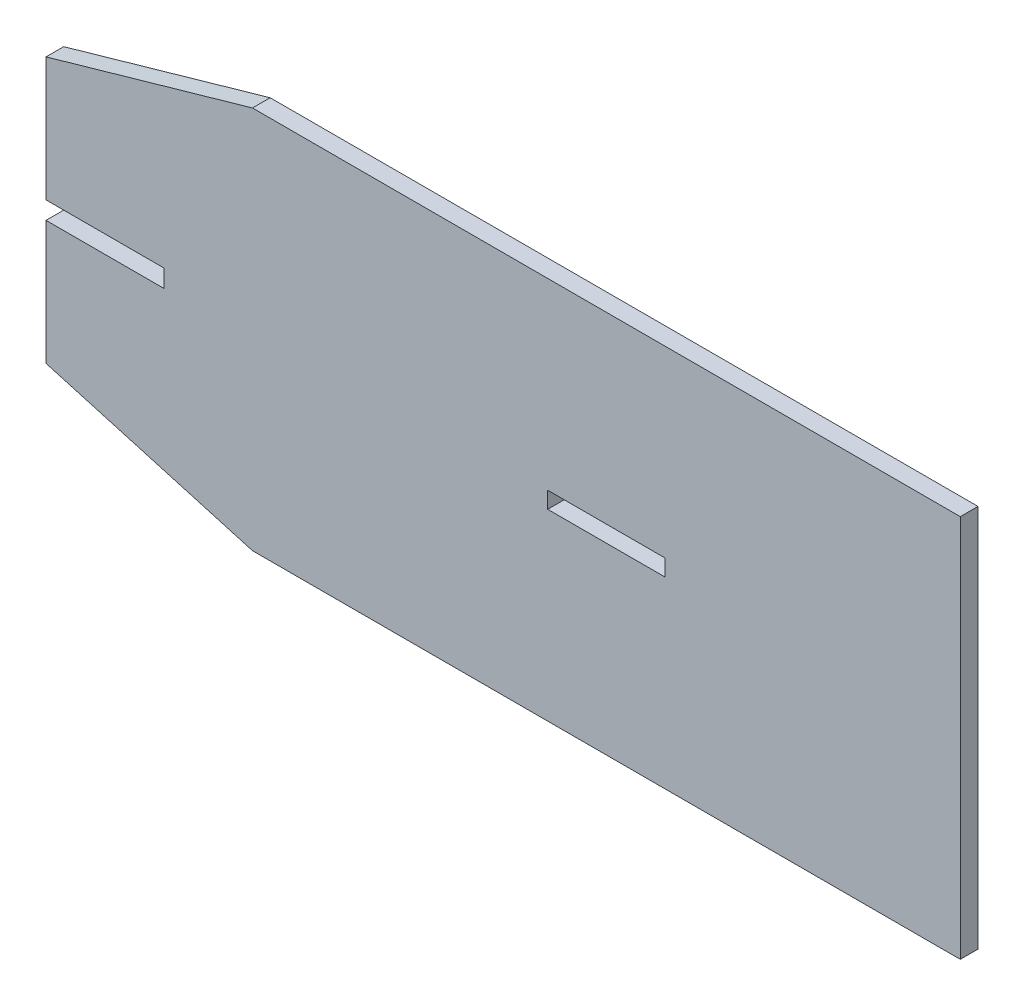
from build123d import *

# Parameters (mm, degrees)
SALIENTE_EXTRUIR1_DEPTH = 3
CROQUIS2_W              = 19.9
CROQUIS2_H              = 2.8
CORTAR_EXTRUIR1_DEPTH   = 3


with BuildPart() as part:
    # Croquis1 → Saliente-Extruir1 (new body)
    with BuildSketch(Plane.XY):
        Polygon((-60, 32.5), (-95, 22.5), (-95, 1.5), (-75, 1.5), (-75, -1.5), (-95, -1.5), (-95, -22.5), (-60, -32.5), (60, -32.5), (60, 32.5), align=None)
    extrude(amount=SALIENTE_EXTRUIR1_DEPTH)

    # Croquis2 → Cortar-Extruir1 (cut)
    with BuildSketch(Plane.XY.offset(3)):
        Rectangle(CROQUIS2_W, CROQUIS2_H)
    extrude(amount=-CORTAR_EXTRUIR1_DEPTH, mode=Mode.SUBTRACT)


solid = part.part
